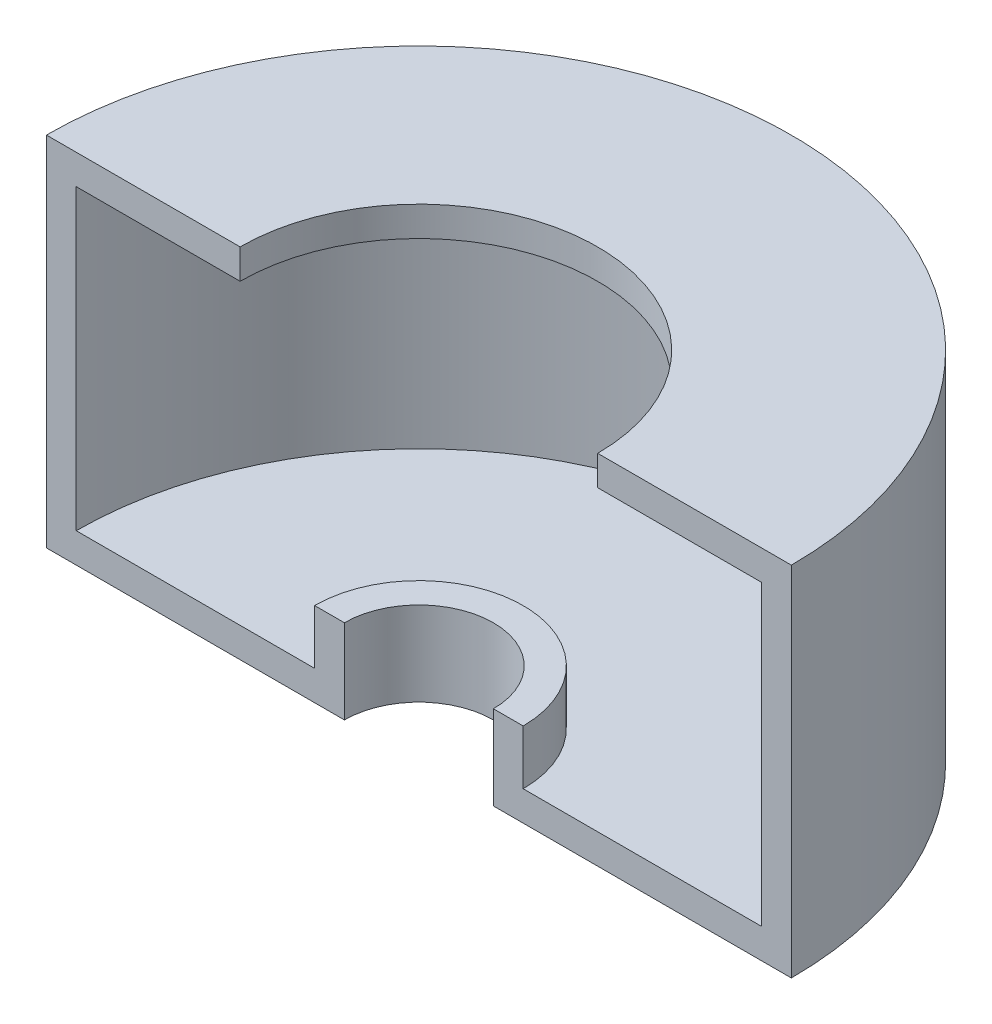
ISO-10303-21;
HEADER;
FILE_DESCRIPTION(('STEP AP214'),'2;1');
FILE_NAME('part.step','',(''),(''),'','','');
FILE_SCHEMA(('AUTOMOTIVE_DESIGN { 1 0 10303 214 1 1 1 1 }'));
ENDSEC;
DATA;
#1=APPLICATION_CONTEXT('core data for automotive mechanical design processes');
#2=APPLICATION_PROTOCOL_DEFINITION('international standard','automotive_design',2000,#1);
#3=PRODUCT_CONTEXT('',#1,'mechanical');
#4=PRODUCT('Part','Part','',(#3));
#5=PRODUCT_RELATED_PRODUCT_CATEGORY('part','',(#4));
#6=PRODUCT_DEFINITION_FORMATION('','',#4);
#7=PRODUCT_DEFINITION_CONTEXT('part definition',#1,'design');
#8=PRODUCT_DEFINITION('design','',#6,#7);
#9=PRODUCT_DEFINITION_SHAPE('','',#8);
#10=(LENGTH_UNIT() NAMED_UNIT(*) SI_UNIT(.MILLI.,.METRE.));
#11=(NAMED_UNIT(*) PLANE_ANGLE_UNIT() SI_UNIT($,.RADIAN.));
#12=(NAMED_UNIT(*) SI_UNIT($,.STERADIAN.) SOLID_ANGLE_UNIT());
#13=UNCERTAINTY_MEASURE_WITH_UNIT(LENGTH_MEASURE(1.E-05),#10,'distance_accuracy_value','');
#14=(GEOMETRIC_REPRESENTATION_CONTEXT(3) GLOBAL_UNCERTAINTY_ASSIGNED_CONTEXT((#13)) GLOBAL_UNIT_ASSIGNED_CONTEXT((#10,
#11,#12)) REPRESENTATION_CONTEXT('',''));
#15=CARTESIAN_POINT('',(0.,0.,0.));
#16=DIRECTION('',(0.,0.,1.));
#17=DIRECTION('',(1.,0.,0.));
#18=AXIS2_PLACEMENT_3D('',#15,#16,#17);
#19=CARTESIAN_POINT('',(-30.,85.8724823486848,2.09488880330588E-13));
#20=DIRECTION('',(0.,1.,0.));
#21=DIRECTION('',(0.,0.,1.));
#22=AXIS2_PLACEMENT_3D('',#19,#20,#21);
#23=PLANE('',#22);
#24=CARTESIAN_POINT('',(0.,85.8724823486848,0.));
#25=DIRECTION('',(0.,-1.,0.));
#26=DIRECTION('',(0.,0.,-1.));
#27=AXIS2_PLACEMENT_3D('',#24,#25,#26);
#28=CIRCLE('',#27,30.);
#29=CARTESIAN_POINT('',(-30.,85.8724823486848,2.09488880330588E-13));
#30=VERTEX_POINT('',#29);
#31=CARTESIAN_POINT('',(30.,85.8724823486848,0.));
#32=VERTEX_POINT('',#31);
#33=EDGE_CURVE('E11',#30,#32,#28,.T.);
#34=ORIENTED_EDGE('',*,*,#33,.T.);
#35=DIRECTION('',(1.,0.,0.));
#36=VECTOR('',#35,1.);
#37=CARTESIAN_POINT('',(30.,85.8724823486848,0.));
#38=LINE('',#37,#36);
#39=CARTESIAN_POINT('',(62.4999999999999,85.8724823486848,0.));
#40=VERTEX_POINT('',#39);
#41=EDGE_CURVE('E108',#40,#32,#38,.F.);
#42=ORIENTED_EDGE('',*,*,#41,.F.);
#43=CARTESIAN_POINT('',(0.,85.8724823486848,0.));
#44=DIRECTION('',(0.,-1.,0.));
#45=DIRECTION('',(0.,0.,-1.));
#46=AXIS2_PLACEMENT_3D('',#43,#44,#45);
#47=CIRCLE('',#46,62.4999999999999);
#48=CARTESIAN_POINT('',(-62.4999999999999,85.8724823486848,4.36435167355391E-13));
#49=VERTEX_POINT('',#48);
#50=EDGE_CURVE('E47',#49,#40,#47,.T.);
#51=ORIENTED_EDGE('',*,*,#50,.F.);
#52=DIRECTION('',(-1.,0.,0.));
#53=VECTOR('',#52,1.);
#54=CARTESIAN_POINT('',(-30.,85.8724823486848,2.09488880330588E-13));
#55=LINE('',#54,#53);
#56=EDGE_CURVE('E110',#49,#30,#55,.F.);
#57=ORIENTED_EDGE('',*,*,#56,.T.);
#58=EDGE_LOOP('',(#34,#42,#51,#57));
#59=FACE_BOUND('',#58,.T.);
#60=ADVANCED_FACE('F32',(#59),#23,.T.);
#61=CARTESIAN_POINT('',(0.,100.,0.));
#62=DIRECTION('',(0.,-1.,0.));
#63=DIRECTION('',(0.,0.,-1.));
#64=AXIS2_PLACEMENT_3D('',#61,#62,#63);
#65=CYLINDRICAL_SURFACE('',#64,30.);
#66=CARTESIAN_POINT('',(0.,80.8724823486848,0.));
#67=DIRECTION('',(0.,-1.,0.));
#68=DIRECTION('',(0.,0.,-1.));
#69=AXIS2_PLACEMENT_3D('',#66,#67,#68);
#70=CIRCLE('',#69,30.);
#71=CARTESIAN_POINT('',(-30.,80.8724823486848,2.09488880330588E-13));
#72=VERTEX_POINT('',#71);
#73=CARTESIAN_POINT('',(30.,80.8724823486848,0.));
#74=VERTEX_POINT('',#73);
#75=EDGE_CURVE('E40',#72,#74,#70,.T.);
#76=ORIENTED_EDGE('',*,*,#75,.T.);
#77=DIRECTION('',(0.,1.,0.));
#78=VECTOR('',#77,1.);
#79=CARTESIAN_POINT('',(30.,80.8724823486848,0.));
#80=LINE('',#79,#78);
#81=EDGE_CURVE('E119',#74,#32,#80,.T.);
#82=ORIENTED_EDGE('',*,*,#81,.T.);
#83=ORIENTED_EDGE('',*,*,#33,.F.);
#84=DIRECTION('',(0.,1.,0.));
#85=VECTOR('',#84,1.);
#86=CARTESIAN_POINT('',(-30.,80.8724823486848,2.09488880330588E-13));
#87=LINE('',#86,#85);
#88=EDGE_CURVE('E147',#72,#30,#87,.T.);
#89=ORIENTED_EDGE('',*,*,#88,.F.);
#90=EDGE_LOOP('',(#76,#82,#83,#89));
#91=FACE_BOUND('',#90,.T.);
#92=ADVANCED_FACE('F34',(#91),#65,.F.);
#93=CARTESIAN_POINT('',(-30.,80.8724823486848,2.09488880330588E-13));
#94=DIRECTION('',(0.,1.,0.));
#95=DIRECTION('',(0.,0.,1.));
#96=AXIS2_PLACEMENT_3D('',#93,#94,#95);
#97=PLANE('',#96);
#98=CARTESIAN_POINT('',(0.,80.8724823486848,0.));
#99=DIRECTION('',(0.,-1.,0.));
#100=DIRECTION('',(0.,0.,-1.));
#101=AXIS2_PLACEMENT_3D('',#98,#99,#100);
#102=CIRCLE('',#101,57.4999999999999);
#103=CARTESIAN_POINT('',(-57.4999999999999,80.8724823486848,4.0152035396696E-13));
#104=VERTEX_POINT('',#103);
#105=CARTESIAN_POINT('',(57.4999999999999,80.8724823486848,0.));
#106=VERTEX_POINT('',#105);
#107=EDGE_CURVE('E183',#104,#106,#102,.T.);
#108=ORIENTED_EDGE('',*,*,#107,.T.);
#109=DIRECTION('',(-1.,0.,0.));
#110=VECTOR('',#109,1.);
#111=CARTESIAN_POINT('',(30.,80.8724823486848,0.));
#112=LINE('',#111,#110);
#113=EDGE_CURVE('E124',#106,#74,#112,.T.);
#114=ORIENTED_EDGE('',*,*,#113,.T.);
#115=ORIENTED_EDGE('',*,*,#75,.F.);
#116=DIRECTION('',(1.,0.,0.));
#117=VECTOR('',#116,1.);
#118=CARTESIAN_POINT('',(-30.,80.8724823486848,2.09488880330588E-13));
#119=LINE('',#118,#117);
#120=EDGE_CURVE('E149',#104,#72,#119,.T.);
#121=ORIENTED_EDGE('',*,*,#120,.F.);
#122=EDGE_LOOP('',(#108,#114,#115,#121));
#123=FACE_BOUND('',#122,.T.);
#124=ADVANCED_FACE('F186',(#123),#97,.F.);
#125=CARTESIAN_POINT('',(0.,100.,0.));
#126=DIRECTION('',(0.,-1.,0.));
#127=DIRECTION('',(0.,0.,-1.));
#128=AXIS2_PLACEMENT_3D('',#125,#126,#127);
#129=CYLINDRICAL_SURFACE('',#128,57.4999999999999);
#130=CARTESIAN_POINT('',(0.,30.8724823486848,0.));
#131=DIRECTION('',(0.,-1.,0.));
#132=DIRECTION('',(0.,0.,-1.));
#133=AXIS2_PLACEMENT_3D('',#130,#131,#132);
#134=CIRCLE('',#133,57.4999999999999);
#135=CARTESIAN_POINT('',(-57.4999999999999,30.8724823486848,4.0152035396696E-13));
#136=VERTEX_POINT('',#135);
#137=CARTESIAN_POINT('',(57.4999999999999,30.8724823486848,0.));
#138=VERTEX_POINT('',#137);
#139=EDGE_CURVE('E181',#136,#138,#134,.T.);
#140=ORIENTED_EDGE('',*,*,#139,.T.);
#141=DIRECTION('',(0.,1.,0.));
#142=VECTOR('',#141,1.);
#143=CARTESIAN_POINT('',(57.4999999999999,80.8724823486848,0.));
#144=LINE('',#143,#142);
#145=EDGE_CURVE('E126',#138,#106,#144,.T.);
#146=ORIENTED_EDGE('',*,*,#145,.T.);
#147=ORIENTED_EDGE('',*,*,#107,.F.);
#148=DIRECTION('',(0.,1.,0.));
#149=VECTOR('',#148,1.);
#150=CARTESIAN_POINT('',(-57.4999999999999,80.8724823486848,4.0152035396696E-13));
#151=LINE('',#150,#149);
#152=EDGE_CURVE('E152',#136,#104,#151,.T.);
#153=ORIENTED_EDGE('',*,*,#152,.F.);
#154=EDGE_LOOP('',(#140,#146,#147,#153));
#155=FACE_BOUND('',#154,.T.);
#156=ADVANCED_FACE('F191',(#155),#129,.F.);
#157=CARTESIAN_POINT('',(-17.5,30.8724823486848,1.2220184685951E-13));
#158=DIRECTION('',(0.,-1.,0.));
#159=DIRECTION('',(0.,0.,-1.));
#160=AXIS2_PLACEMENT_3D('',#157,#158,#159);
#161=PLANE('',#160);
#162=CARTESIAN_POINT('',(0.,30.8724823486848,0.));
#163=DIRECTION('',(0.,-1.,0.));
#164=DIRECTION('',(0.,0.,-1.));
#165=AXIS2_PLACEMENT_3D('',#162,#163,#164);
#166=CIRCLE('',#165,17.5);
#167=CARTESIAN_POINT('',(-17.5,30.8724823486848,1.2220184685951E-13));
#168=VERTEX_POINT('',#167);
#169=CARTESIAN_POINT('',(17.5,30.8724823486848,0.));
#170=VERTEX_POINT('',#169);
#171=EDGE_CURVE('E179',#168,#170,#166,.T.);
#172=ORIENTED_EDGE('',*,*,#171,.T.);
#173=DIRECTION('',(1.,0.,0.));
#174=VECTOR('',#173,1.);
#175=CARTESIAN_POINT('',(17.5,30.8724823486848,0.));
#176=LINE('',#175,#174);
#177=EDGE_CURVE('E131',#170,#138,#176,.T.);
#178=ORIENTED_EDGE('',*,*,#177,.T.);
#179=ORIENTED_EDGE('',*,*,#139,.F.);
#180=DIRECTION('',(-1.,0.,0.));
#181=VECTOR('',#180,1.);
#182=CARTESIAN_POINT('',(-17.5,30.8724823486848,1.2220184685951E-13));
#183=LINE('',#182,#181);
#184=EDGE_CURVE('E155',#168,#136,#183,.T.);
#185=ORIENTED_EDGE('',*,*,#184,.F.);
#186=EDGE_LOOP('',(#172,#178,#179,#185));
#187=FACE_BOUND('',#186,.T.);
#188=ADVANCED_FACE('F194',(#187),#161,.F.);
#189=CARTESIAN_POINT('',(0.,100.,0.));
#190=DIRECTION('',(0.,-1.,0.));
#191=DIRECTION('',(0.,0.,-1.));
#192=AXIS2_PLACEMENT_3D('',#189,#190,#191);
#193=CYLINDRICAL_SURFACE('',#192,17.5);
#194=CARTESIAN_POINT('',(0.,40.,0.));
#195=DIRECTION('',(0.,-1.,0.));
#196=DIRECTION('',(0.,0.,-1.));
#197=AXIS2_PLACEMENT_3D('',#194,#195,#196);
#198=CIRCLE('',#197,17.5);
#199=CARTESIAN_POINT('',(-17.5,40.,1.2220184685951E-13));
#200=VERTEX_POINT('',#199);
#201=CARTESIAN_POINT('',(17.5,40.,0.));
#202=VERTEX_POINT('',#201);
#203=EDGE_CURVE('E177',#200,#202,#198,.T.);
#204=ORIENTED_EDGE('',*,*,#203,.T.);
#205=DIRECTION('',(0.,-1.,0.));
#206=VECTOR('',#205,1.);
#207=CARTESIAN_POINT('',(17.5,30.8724823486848,0.));
#208=LINE('',#207,#206);
#209=EDGE_CURVE('E134',#202,#170,#208,.T.);
#210=ORIENTED_EDGE('',*,*,#209,.T.);
#211=ORIENTED_EDGE('',*,*,#171,.F.);
#212=DIRECTION('',(0.,-1.,0.));
#213=VECTOR('',#212,1.);
#214=CARTESIAN_POINT('',(-17.5,30.8724823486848,1.2220184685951E-13));
#215=LINE('',#214,#213);
#216=EDGE_CURVE('E158',#200,#168,#215,.T.);
#217=ORIENTED_EDGE('',*,*,#216,.F.);
#218=EDGE_LOOP('',(#204,#210,#211,#217));
#219=FACE_BOUND('',#218,.T.);
#220=ADVANCED_FACE('F198',(#219),#193,.T.);
#221=CARTESIAN_POINT('',(-12.5,40.,0.));
#222=DIRECTION('',(0.,-1.,0.));
#223=DIRECTION('',(0.,0.,-1.));
#224=AXIS2_PLACEMENT_3D('',#221,#222,#223);
#225=PLANE('',#224);
#226=CARTESIAN_POINT('',(0.,40.,0.));
#227=DIRECTION('',(0.,-1.,0.));
#228=DIRECTION('',(0.,0.,-1.));
#229=AXIS2_PLACEMENT_3D('',#226,#227,#228);
#230=CIRCLE('',#229,12.5);
#231=CARTESIAN_POINT('',(-12.5,40.,0.));
#232=VERTEX_POINT('',#231);
#233=CARTESIAN_POINT('',(12.5,40.,0.));
#234=VERTEX_POINT('',#233);
#235=EDGE_CURVE('E175',#232,#234,#230,.T.);
#236=ORIENTED_EDGE('',*,*,#235,.T.);
#237=DIRECTION('',(1.,0.,0.));
#238=VECTOR('',#237,1.);
#239=CARTESIAN_POINT('',(12.5,40.,0.));
#240=LINE('',#239,#238);
#241=EDGE_CURVE('E137',#234,#202,#240,.T.);
#242=ORIENTED_EDGE('',*,*,#241,.T.);
#243=ORIENTED_EDGE('',*,*,#203,.F.);
#244=DIRECTION('',(-1.,0.,0.));
#245=VECTOR('',#244,1.);
#246=CARTESIAN_POINT('',(-12.5,40.,0.));
#247=LINE('',#246,#245);
#248=EDGE_CURVE('E161',#232,#200,#247,.T.);
#249=ORIENTED_EDGE('',*,*,#248,.F.);
#250=EDGE_LOOP('',(#236,#242,#243,#249));
#251=FACE_BOUND('',#250,.T.);
#252=ADVANCED_FACE('F202',(#251),#225,.F.);
#253=CARTESIAN_POINT('',(0.,100.,0.));
#254=DIRECTION('',(0.,-1.,0.));
#255=DIRECTION('',(0.,0.,-1.));
#256=AXIS2_PLACEMENT_3D('',#253,#254,#255);
#257=CYLINDRICAL_SURFACE('',#256,12.5);
#258=CARTESIAN_POINT('',(0.,25.8724823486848,0.));
#259=DIRECTION('',(0.,-1.,0.));
#260=DIRECTION('',(0.,0.,-1.));
#261=AXIS2_PLACEMENT_3D('',#258,#259,#260);
#262=CIRCLE('',#261,12.5);
#263=CARTESIAN_POINT('',(-12.5,25.8724823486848,0.));
#264=VERTEX_POINT('',#263);
#265=CARTESIAN_POINT('',(12.5,25.8724823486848,0.));
#266=VERTEX_POINT('',#265);
#267=EDGE_CURVE('E173',#264,#266,#262,.T.);
#268=ORIENTED_EDGE('',*,*,#267,.T.);
#269=DIRECTION('',(0.,1.,0.));
#270=VECTOR('',#269,1.);
#271=CARTESIAN_POINT('',(12.5,30.8724823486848,0.));
#272=LINE('',#271,#270);
#273=EDGE_CURVE('E140',#234,#266,#272,.F.);
#274=ORIENTED_EDGE('',*,*,#273,.F.);
#275=ORIENTED_EDGE('',*,*,#235,.F.);
#276=DIRECTION('',(0.,1.,0.));
#277=VECTOR('',#276,1.);
#278=CARTESIAN_POINT('',(-12.5,30.8724823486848,0.));
#279=LINE('',#278,#277);
#280=EDGE_CURVE('E164',#232,#264,#279,.F.);
#281=ORIENTED_EDGE('',*,*,#280,.T.);
#282=EDGE_LOOP('',(#268,#274,#275,#281));
#283=FACE_BOUND('',#282,.T.);
#284=ADVANCED_FACE('F207',(#283),#257,.F.);
#285=CARTESIAN_POINT('',(-17.5,25.8724823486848,1.2220184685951E-13));
#286=DIRECTION('',(0.,-1.,0.));
#287=DIRECTION('',(0.,0.,-1.));
#288=AXIS2_PLACEMENT_3D('',#285,#286,#287);
#289=PLANE('',#288);
#290=CARTESIAN_POINT('',(0.,25.8724823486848,0.));
#291=DIRECTION('',(0.,-1.,0.));
#292=DIRECTION('',(0.,0.,-1.));
#293=AXIS2_PLACEMENT_3D('',#290,#291,#292);
#294=CIRCLE('',#293,62.4999999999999);
#295=CARTESIAN_POINT('',(-62.4999999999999,25.8724823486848,4.36435167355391E-13));
#296=VERTEX_POINT('',#295);
#297=CARTESIAN_POINT('',(62.4999999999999,25.8724823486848,0.));
#298=VERTEX_POINT('',#297);
#299=EDGE_CURVE('E55',#296,#298,#294,.T.);
#300=ORIENTED_EDGE('',*,*,#299,.T.);
#301=DIRECTION('',(1.,0.,0.));
#302=VECTOR('',#301,1.);
#303=CARTESIAN_POINT('',(17.5,25.8724823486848,0.));
#304=LINE('',#303,#302);
#305=EDGE_CURVE('E143',#266,#298,#304,.T.);
#306=ORIENTED_EDGE('',*,*,#305,.F.);
#307=ORIENTED_EDGE('',*,*,#267,.F.);
#308=DIRECTION('',(-1.,0.,0.));
#309=VECTOR('',#308,1.);
#310=CARTESIAN_POINT('',(-17.5,25.8724823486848,1.2220184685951E-13));
#311=LINE('',#310,#309);
#312=EDGE_CURVE('E167',#264,#296,#311,.T.);
#313=ORIENTED_EDGE('',*,*,#312,.T.);
#314=EDGE_LOOP('',(#300,#306,#307,#313));
#315=FACE_BOUND('',#314,.T.);
#316=ADVANCED_FACE('F210',(#315),#289,.T.);
#317=CARTESIAN_POINT('',(0.,100.,0.));
#318=DIRECTION('',(0.,-1.,0.));
#319=DIRECTION('',(0.,0.,-1.));
#320=AXIS2_PLACEMENT_3D('',#317,#318,#319);
#321=CYLINDRICAL_SURFACE('',#320,62.4999999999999);
#322=DIRECTION('',(0.,1.,0.));
#323=VECTOR('',#322,1.);
#324=CARTESIAN_POINT('',(-62.4999999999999,80.8724823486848,4.36435167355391E-13));
#325=LINE('',#324,#323);
#326=EDGE_CURVE('E169',#296,#49,#325,.T.);
#327=ORIENTED_EDGE('',*,*,#326,.T.);
#328=ORIENTED_EDGE('',*,*,#50,.T.);
#329=DIRECTION('',(0.,1.,0.));
#330=VECTOR('',#329,1.);
#331=CARTESIAN_POINT('',(62.4999999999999,80.8724823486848,0.));
#332=LINE('',#331,#330);
#333=EDGE_CURVE('E122',#298,#40,#332,.T.);
#334=ORIENTED_EDGE('',*,*,#333,.F.);
#335=ORIENTED_EDGE('',*,*,#299,.F.);
#336=EDGE_LOOP('',(#327,#328,#334,#335));
#337=FACE_BOUND('',#336,.T.);
#338=ADVANCED_FACE('F212',(#337),#321,.T.);
#339=CARTESIAN_POINT('',(-30.,85.8724823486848,2.09488880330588E-13));
#340=DIRECTION('',(0.,0.,-1.));
#341=DIRECTION('',(-1.,0.,0.));
#342=AXIS2_PLACEMENT_3D('',#339,#340,#341);
#343=PLANE('',#342);
#344=ORIENTED_EDGE('',*,*,#56,.F.);
#345=ORIENTED_EDGE('',*,*,#326,.F.);
#346=ORIENTED_EDGE('',*,*,#312,.F.);
#347=ORIENTED_EDGE('',*,*,#280,.F.);
#348=ORIENTED_EDGE('',*,*,#248,.T.);
#349=ORIENTED_EDGE('',*,*,#216,.T.);
#350=ORIENTED_EDGE('',*,*,#184,.T.);
#351=ORIENTED_EDGE('',*,*,#152,.T.);
#352=ORIENTED_EDGE('',*,*,#120,.T.);
#353=ORIENTED_EDGE('',*,*,#88,.T.);
#354=EDGE_LOOP('',(#344,#345,#346,#347,#348,#349,#350,#351,#352,#353));
#355=FACE_BOUND('',#354,.T.);
#356=ADVANCED_FACE('F214',(#355),#343,.F.);
#357=CARTESIAN_POINT('',(30.,85.8724823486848,0.));
#358=DIRECTION('',(0.,0.,1.));
#359=DIRECTION('',(1.,0.,0.));
#360=AXIS2_PLACEMENT_3D('',#357,#358,#359);
#361=PLANE('',#360);
#362=ORIENTED_EDGE('',*,*,#41,.T.);
#363=ORIENTED_EDGE('',*,*,#81,.F.);
#364=ORIENTED_EDGE('',*,*,#113,.F.);
#365=ORIENTED_EDGE('',*,*,#145,.F.);
#366=ORIENTED_EDGE('',*,*,#177,.F.);
#367=ORIENTED_EDGE('',*,*,#209,.F.);
#368=ORIENTED_EDGE('',*,*,#241,.F.);
#369=ORIENTED_EDGE('',*,*,#273,.T.);
#370=ORIENTED_EDGE('',*,*,#305,.T.);
#371=ORIENTED_EDGE('',*,*,#333,.T.);
#372=EDGE_LOOP('',(#362,#363,#364,#365,#366,#367,#368,#369,#370,#371));
#373=FACE_BOUND('',#372,.T.);
#374=ADVANCED_FACE('F117',(#373),#361,.T.);
#375=CLOSED_SHELL('',(#60,#92,#124,#156,#188,#220,#252,#284,#316,#338,#356,#374));
#376=MANIFOLD_SOLID_BREP('B2',#375);
#377=ADVANCED_BREP_SHAPE_REPRESENTATION('',(#18,#376),#14);
#378=SHAPE_DEFINITION_REPRESENTATION(#9,#377);
ENDSEC;
END-ISO-10303-21;
